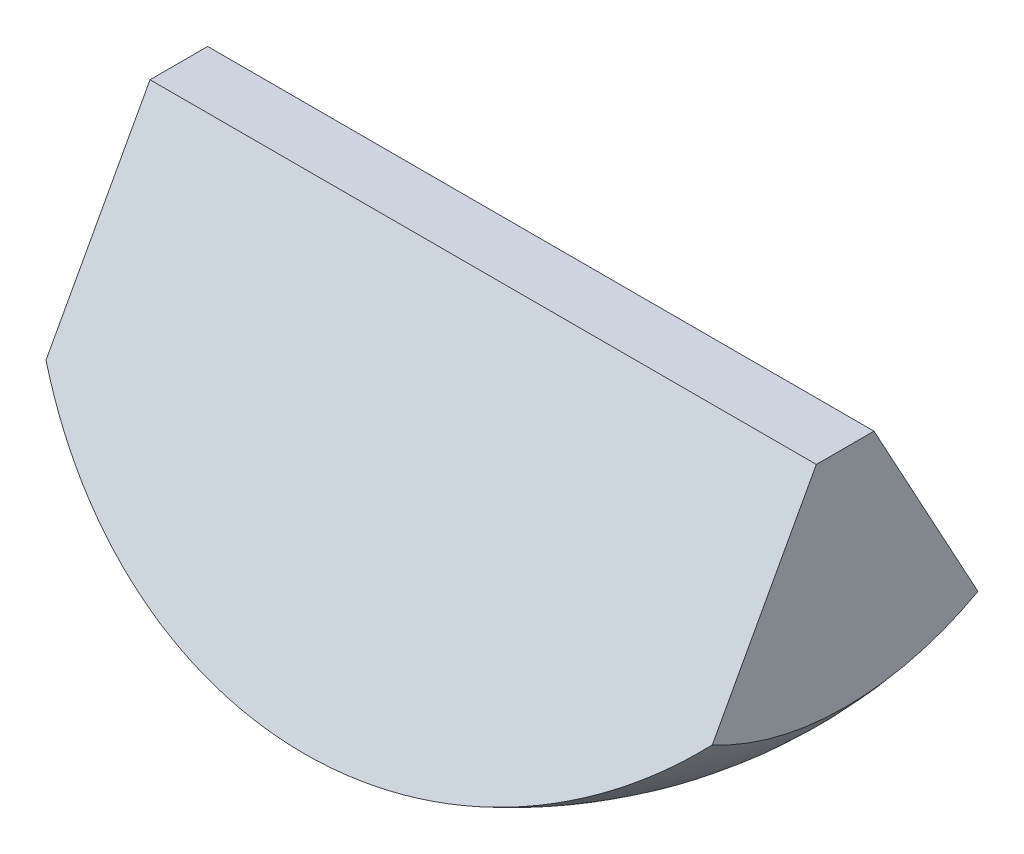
ISO-10303-21;
HEADER;
FILE_DESCRIPTION(('STEP AP214'),'2;1');
FILE_NAME('part.step','',(''),(''),'','','');
FILE_SCHEMA(('AUTOMOTIVE_DESIGN { 1 0 10303 214 1 1 1 1 }'));
ENDSEC;
DATA;
#1=APPLICATION_CONTEXT('core data for automotive mechanical design processes');
#2=APPLICATION_PROTOCOL_DEFINITION('international standard','automotive_design',2000,#1);
#3=PRODUCT_CONTEXT('',#1,'mechanical');
#4=PRODUCT('Part','Part','',(#3));
#5=PRODUCT_RELATED_PRODUCT_CATEGORY('part','',(#4));
#6=PRODUCT_DEFINITION_FORMATION('','',#4);
#7=PRODUCT_DEFINITION_CONTEXT('part definition',#1,'design');
#8=PRODUCT_DEFINITION('design','',#6,#7);
#9=PRODUCT_DEFINITION_SHAPE('','',#8);
#10=(LENGTH_UNIT() NAMED_UNIT(*) SI_UNIT(.MILLI.,.METRE.));
#11=(NAMED_UNIT(*) PLANE_ANGLE_UNIT() SI_UNIT($,.RADIAN.));
#12=(NAMED_UNIT(*) SI_UNIT($,.STERADIAN.) SOLID_ANGLE_UNIT());
#13=UNCERTAINTY_MEASURE_WITH_UNIT(LENGTH_MEASURE(1.E-05),#10,'distance_accuracy_value','');
#14=(GEOMETRIC_REPRESENTATION_CONTEXT(3) GLOBAL_UNCERTAINTY_ASSIGNED_CONTEXT((#13)) GLOBAL_UNIT_ASSIGNED_CONTEXT((#10,
#11,#12)) REPRESENTATION_CONTEXT('',''));
#15=CARTESIAN_POINT('',(0.,0.,0.));
#16=DIRECTION('',(0.,0.,1.));
#17=DIRECTION('',(1.,0.,0.));
#18=AXIS2_PLACEMENT_3D('',#15,#16,#17);
#19=CARTESIAN_POINT('',(0.,0.,0.));
#20=DIRECTION('',(0.,1.,0.));
#21=DIRECTION('',(1.,0.,0.));
#22=AXIS2_PLACEMENT_3D('',#19,#20,#21);
#23=SPHERICAL_SURFACE('',#22,41.);
#24=CARTESIAN_POINT('',(31.5,0.,0.));
#25=DIRECTION('',(-1.,0.,0.));
#26=DIRECTION('',(0.,0.,1.));
#27=AXIS2_PLACEMENT_3D('',#24,#25,#26);
#28=CIRCLE('',#27,26.2440469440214);
#29=CARTESIAN_POINT('',(31.5,-23.0435534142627,-12.5596435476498));
#30=VERTEX_POINT('',#29);
#31=CARTESIAN_POINT('',(31.5,-23.0435534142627,12.5596435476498));
#32=VERTEX_POINT('',#31);
#33=EDGE_CURVE('E82',#30,#32,#28,.T.);
#34=ORIENTED_EDGE('',*,*,#33,.T.);
#35=CARTESIAN_POINT('',(0.,0.,0.));
#36=DIRECTION('',(0.,0.478571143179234,0.878048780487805));
#37=DIRECTION('',(0.,-0.878048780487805,0.478571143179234));
#38=AXIS2_PLACEMENT_3D('',#35,#36,#37);
#39=CIRCLE('',#38,41.);
#40=CARTESIAN_POINT('',(-31.5,-23.0435534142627,12.5596435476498));
#41=VERTEX_POINT('',#40);
#42=EDGE_CURVE('E53',#41,#32,#39,.T.);
#43=ORIENTED_EDGE('',*,*,#42,.F.);
#44=CARTESIAN_POINT('',(-31.5,0.,0.));
#45=DIRECTION('',(1.,0.,0.));
#46=DIRECTION('',(0.,0.,-1.));
#47=AXIS2_PLACEMENT_3D('',#44,#45,#46);
#48=CIRCLE('',#47,26.2440469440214);
#49=CARTESIAN_POINT('',(-31.5,-23.0435534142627,-12.5596435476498));
#50=VERTEX_POINT('',#49);
#51=EDGE_CURVE('E84',#41,#50,#48,.T.);
#52=ORIENTED_EDGE('',*,*,#51,.T.);
#53=CARTESIAN_POINT('',(0.,0.,0.));
#54=DIRECTION('',(0.,0.478571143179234,-0.878048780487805));
#55=DIRECTION('',(0.,0.878048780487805,0.478571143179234));
#56=AXIS2_PLACEMENT_3D('',#53,#54,#55);
#57=CIRCLE('',#56,41.);
#58=EDGE_CURVE('E80',#30,#50,#57,.T.);
#59=ORIENTED_EDGE('',*,*,#58,.F.);
#60=EDGE_LOOP('',(#34,#43,#52,#59));
#61=FACE_BOUND('',#60,.T.);
#62=ADVANCED_FACE('F40',(#61),#23,.T.);
#63=CARTESIAN_POINT('',(-65.376399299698,-5.,-50.));
#64=DIRECTION('',(0.,-1.,0.));
#65=DIRECTION('',(0.,0.,-1.));
#66=AXIS2_PLACEMENT_3D('',#63,#64,#65);
#67=PLANE('',#66);
#68=DIRECTION('',(-1.,0.,0.));
#69=VECTOR('',#68,1.);
#70=CARTESIAN_POINT('',(-65.376399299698,-5.,2.72519678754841));
#71=LINE('',#70,#69);
#72=CARTESIAN_POINT('',(31.5,-4.99999999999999,2.72519678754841));
#73=VERTEX_POINT('',#72);
#74=CARTESIAN_POINT('',(-31.5,-5.,2.72519678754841));
#75=VERTEX_POINT('',#74);
#76=EDGE_CURVE('E86',#73,#75,#71,.T.);
#77=ORIENTED_EDGE('',*,*,#76,.F.);
#78=DIRECTION('',(0.,0.,-1.));
#79=VECTOR('',#78,1.);
#80=CARTESIAN_POINT('',(31.5,-5.,-50.));
#81=LINE('',#80,#79);
#82=CARTESIAN_POINT('',(31.5,-5.,-2.72519678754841));
#83=VERTEX_POINT('',#82);
#84=EDGE_CURVE('E93',#73,#83,#81,.T.);
#85=ORIENTED_EDGE('',*,*,#84,.T.);
#86=DIRECTION('',(1.,0.,0.));
#87=VECTOR('',#86,1.);
#88=CARTESIAN_POINT('',(-65.376399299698,-5.,-2.72519678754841));
#89=LINE('',#88,#87);
#90=CARTESIAN_POINT('',(-31.5,-5.,-2.72519678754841));
#91=VERTEX_POINT('',#90);
#92=EDGE_CURVE('E61',#91,#83,#89,.T.);
#93=ORIENTED_EDGE('',*,*,#92,.F.);
#94=DIRECTION('',(0.,0.,1.));
#95=VECTOR('',#94,1.);
#96=CARTESIAN_POINT('',(-31.5,-5.,-50.));
#97=LINE('',#96,#95);
#98=EDGE_CURVE('E96',#91,#75,#97,.T.);
#99=ORIENTED_EDGE('',*,*,#98,.T.);
#100=EDGE_LOOP('',(#77,#85,#93,#99));
#101=FACE_BOUND('',#100,.T.);
#102=ADVANCED_FACE('F106',(#101),#67,.F.);
#103=CARTESIAN_POINT('',(-31.5,-100.,-34.9288673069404));
#104=DIRECTION('',(1.,0.,0.));
#105=DIRECTION('',(0.,0.,-1.));
#106=AXIS2_PLACEMENT_3D('',#103,#104,#105);
#107=PLANE('',#106);
#108=DIRECTION('',(0.,-0.878048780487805,0.478571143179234));
#109=VECTOR('',#108,1.);
#110=CARTESIAN_POINT('',(-31.5,-62.4195483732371,34.0211105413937));
#111=LINE('',#110,#109);
#112=EDGE_CURVE('E98',#75,#41,#111,.T.);
#113=ORIENTED_EDGE('',*,*,#112,.F.);
#114=ORIENTED_EDGE('',*,*,#98,.F.);
#115=DIRECTION('',(0.,0.878048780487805,0.478571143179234));
#116=VECTOR('',#115,1.);
#117=CARTESIAN_POINT('',(-31.5,-91.7743838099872,-50.0206511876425));
#118=LINE('',#117,#116);
#119=EDGE_CURVE('E87',#50,#91,#118,.T.);
#120=ORIENTED_EDGE('',*,*,#119,.F.);
#121=ORIENTED_EDGE('',*,*,#51,.F.);
#122=EDGE_LOOP('',(#113,#114,#120,#121));
#123=FACE_BOUND('',#122,.T.);
#124=ADVANCED_FACE('F113',(#123),#107,.F.);
#125=CARTESIAN_POINT('',(31.5,-100.,-34.9288673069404));
#126=DIRECTION('',(-1.,0.,0.));
#127=DIRECTION('',(0.,0.,1.));
#128=AXIS2_PLACEMENT_3D('',#125,#126,#127);
#129=PLANE('',#128);
#130=DIRECTION('',(0.,0.878048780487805,-0.478571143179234));
#131=VECTOR('',#130,1.);
#132=CARTESIAN_POINT('',(31.5,-62.4195483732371,34.0211105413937));
#133=LINE('',#132,#131);
#134=EDGE_CURVE('E12',#32,#73,#133,.T.);
#135=ORIENTED_EDGE('',*,*,#134,.F.);
#136=ORIENTED_EDGE('',*,*,#33,.F.);
#137=DIRECTION('',(0.,-0.878048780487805,-0.478571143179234));
#138=VECTOR('',#137,1.);
#139=CARTESIAN_POINT('',(31.5,-91.7743838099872,-50.0206511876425));
#140=LINE('',#139,#138);
#141=EDGE_CURVE('E47',#83,#30,#140,.T.);
#142=ORIENTED_EDGE('',*,*,#141,.F.);
#143=ORIENTED_EDGE('',*,*,#84,.F.);
#144=EDGE_LOOP('',(#135,#136,#142,#143));
#145=FACE_BOUND('',#144,.T.);
#146=ADVANCED_FACE('F94',(#145),#129,.F.);
#147=CARTESIAN_POINT('',(-120.,0.,0.));
#148=DIRECTION('',(0.,0.478571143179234,-0.878048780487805));
#149=DIRECTION('',(0.,0.878048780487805,0.478571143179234));
#150=AXIS2_PLACEMENT_3D('',#147,#148,#149);
#151=PLANE('',#150);
#152=ORIENTED_EDGE('',*,*,#58,.T.);
#153=ORIENTED_EDGE('',*,*,#119,.T.);
#154=ORIENTED_EDGE('',*,*,#92,.T.);
#155=ORIENTED_EDGE('',*,*,#141,.T.);
#156=EDGE_LOOP('',(#152,#153,#154,#155));
#157=FACE_BOUND('',#156,.T.);
#158=ADVANCED_FACE('F89',(#157),#151,.T.);
#159=CARTESIAN_POINT('',(-120.,0.,0.));
#160=DIRECTION('',(0.,0.478571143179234,0.878048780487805));
#161=DIRECTION('',(0.,-0.878048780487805,0.478571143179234));
#162=AXIS2_PLACEMENT_3D('',#159,#160,#161);
#163=PLANE('',#162);
#164=ORIENTED_EDGE('',*,*,#42,.T.);
#165=ORIENTED_EDGE('',*,*,#134,.T.);
#166=ORIENTED_EDGE('',*,*,#76,.T.);
#167=ORIENTED_EDGE('',*,*,#112,.T.);
#168=EDGE_LOOP('',(#164,#165,#166,#167));
#169=FACE_BOUND('',#168,.T.);
#170=ADVANCED_FACE('F114',(#169),#163,.T.);
#171=CLOSED_SHELL('',(#62,#102,#124,#146,#158,#170));
#172=MANIFOLD_SOLID_BREP('B2',#171);
#173=ADVANCED_BREP_SHAPE_REPRESENTATION('',(#18,#172),#14);
#174=SHAPE_DEFINITION_REPRESENTATION(#9,#173);
ENDSEC;
END-ISO-10303-21;
